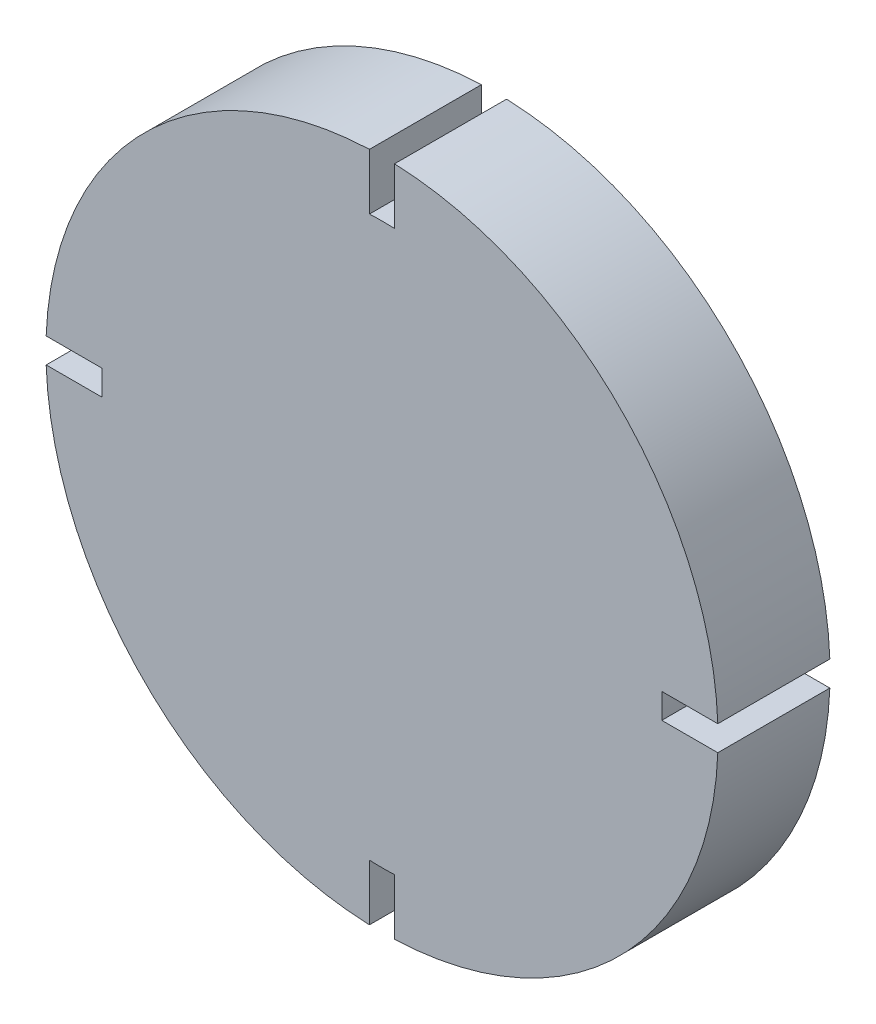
from build123d import *

# Parameters (mm, degrees)
BOSS_EXTRUDE1_DEPTH = 10


with BuildPart() as part:
    # Sketch1 → Boss-Extrude1 (new body)
    with BuildSketch(Plane.XY):
        with BuildLine():
            Line((-1.12, 29.979086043), (-1.12, 24.974899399))
            ThreePointArc((-1.12, 24.974899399), (0, 25), (1.12, 24.974899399))
            Line((1.12, 24.974899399), (1.12, 29.979086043))
            ThreePointArc((1.12, 29.979086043), (21.213203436, 21.213203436), (29.979086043, 1.12))
            Line((29.979086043, 1.12), (24.974899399, 1.12))
            ThreePointArc((24.974899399, 1.12), (25, 0), (24.974899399, -1.12))
            Line((24.974899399, -1.12), (29.979086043, -1.12))
            ThreePointArc((29.979086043, -1.12), (21.213203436, -21.213203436), (1.12, -29.979086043))
            Line((1.12, -29.979086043), (1.12, -24.974899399))
            ThreePointArc((1.12, -24.974899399), (0, -25), (-1.12, -24.974899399))
            Line((-1.12, -24.974899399), (-1.12, -29.979086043))
            ThreePointArc((-1.12, -29.979086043), (-21.213203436, -21.213203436), (-29.979086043, -1.12))
            Line((-29.979086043, -1.12), (-24.974899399, -1.12))
            ThreePointArc((-24.974899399, -1.12), (-25, 0), (-24.974899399, 1.12))
            Line((-24.974899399, 1.12), (-29.979086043, 1.12))
            ThreePointArc((-29.979086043, 1.12), (-21.213203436, 21.213203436), (-1.12, 29.979086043))
        make_face()
    extrude(amount=BOSS_EXTRUDE1_DEPTH)


solid = part.part
